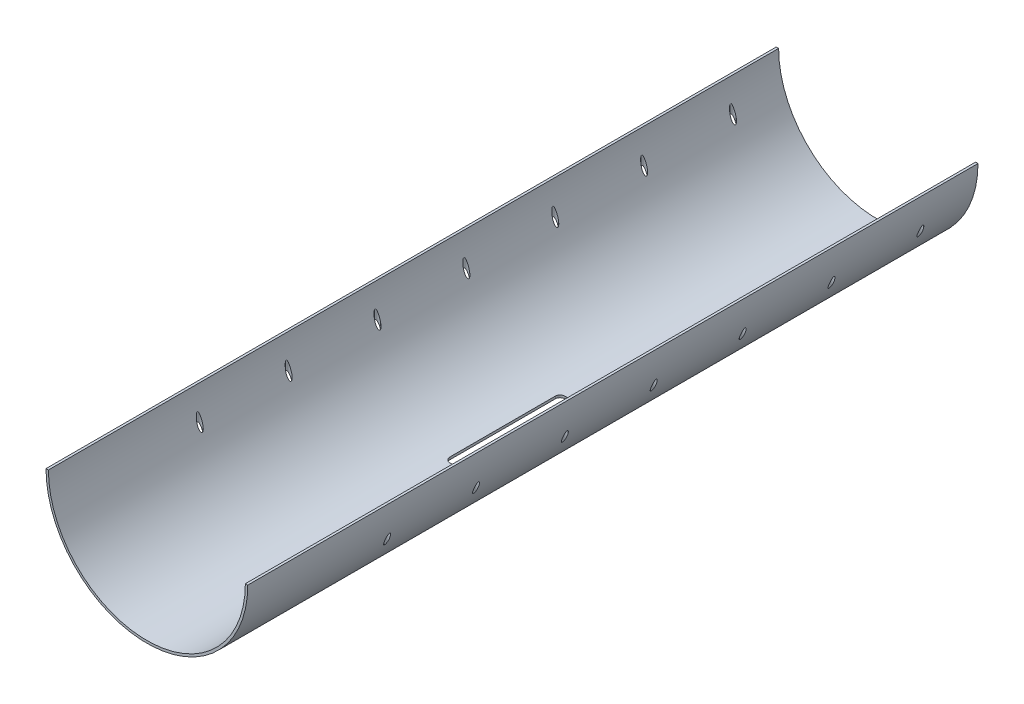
from build123d import *

# Parameters (mm, degrees)
BASE_EXTRUDE_DEPTH = 1930.4
CUT_EXTRUDE1_DEPTH = 1967.90160913
SKETCH3_R          = 6.5532
CUT_EXTRUDE2_DEPTH = 1967.901609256


with BuildPart() as part:
    # Sketch1 → Base-Extrude (new body)
    with BuildSketch(Plane.XY):
        with BuildLine():
            Line((-266.7, 0), (-260.35, 0))
            ThreePointArc((-260.35, 0), (0, -260.35), (260.35, 0))
            Line((260.35, 0), (266.7, 0))
            ThreePointArc((266.7, 0), (0, -266.7), (-266.7, 0))
        make_face()
    extrude(amount=BASE_EXTRUDE_DEPTH)

    # Sketch2 → Cut-Extrude1 (cut, through all)
    with BuildSketch(Plane(origin=(0, 0, 0), x_dir=(1, 0, 0), z_dir=(0, 1, 0))):
        with BuildLine():
            Line((-6.35, -1123.246726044), (6.35, -1123.246726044))
            ThreePointArc((6.35, -1123.246726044), (15.330256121, -1119.526982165), (19.05, -1110.546726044))
            Line((19.05, -1110.546726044), (19.05, -831.146726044))
            ThreePointArc((19.05, -831.146726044), (15.330256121, -822.166469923), (6.35, -818.446726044))
            Line((6.35, -818.446726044), (-6.35, -818.446726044))
            ThreePointArc((-6.35, -818.446726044), (-15.330256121, -822.166469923), (-19.05, -831.146726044))
            Line((-19.05, -831.146726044), (-19.05, -1110.546726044))
            ThreePointArc((-19.05, -1110.546726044), (-15.330256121, -1119.526982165), (-6.35, -1123.246726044))
        make_face()
    extrude(amount=-CUT_EXTRUDE1_DEPTH, mode=Mode.SUBTRACT)

    # Sketch3 → Cut-Extrude2 (cut, through all)
    with BuildSketch(Plane(origin=(0, 0, 0), x_dir=(1, 0, 0), z_dir=(0, 1, 0))):
        with Locations(Location((-247.562851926, -133.35, 0), (0, 0, 270))):
            Circle(SKETCH3_R)
        with Locations(Location((-247.562851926, -368.3, 0), (0, 0, 270))):
            Circle(SKETCH3_R)
        with Locations(Location((-247.562851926, -603.25, 0), (0, 0, 270))):
            Circle(SKETCH3_R)
        with Locations(Location((-247.562851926, -838.2, 0), (0, 0, 270))):
            Circle(SKETCH3_R)
        with Locations(Location((-247.562851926, -1073.15, 0), (0, 0, 270))):
            Circle(SKETCH3_R)
        with Locations(Location((-247.562851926, -1308.1, 0), (0, 0, 270))):
            Circle(SKETCH3_R)
        with Locations(Location((-247.562851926, -1543.05, 0), (0, 0, 270))):
            Circle(SKETCH3_R)
    cut_extrude2 = extrude(amount=-CUT_EXTRUDE2_DEPTH, mode=Mode.SUBTRACT)

    # Mirror1: Cut-Extrude2 across plane
    add(cut_extrude2.mirror(Plane(origin=(0, 0, 0), x_dir=(0, 0, 1), z_dir=(1, 0, 0))), mode=Mode.SUBTRACT)


solid = part.part
